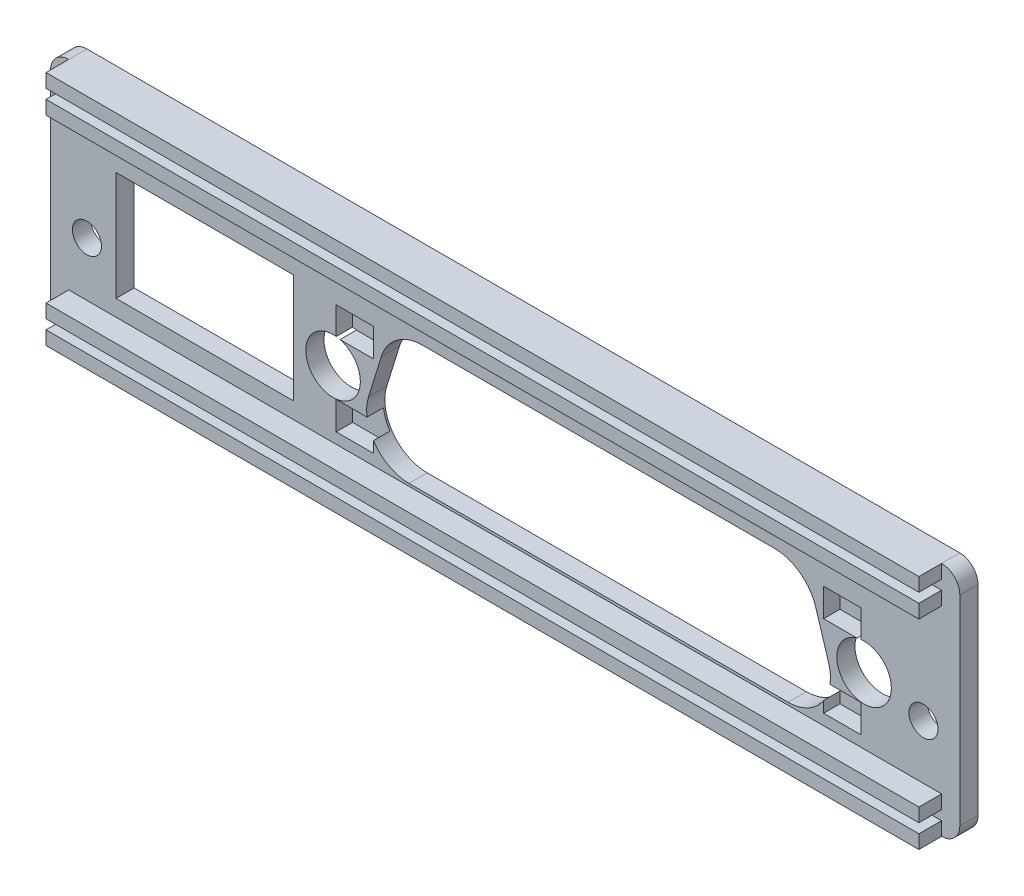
from build123d import *

# Parameters (mm, degrees)
SKETCH1_W                       = 112.5
SKETCH1_H                       = 24.2
BOSS_EXTRUDE1_DEPTH             = 4.5
SKETCH2_R                       = 3
SKETCH2_W                       = 19.5
SKETCH2_H                       = 12
CUT_EXTRUDE1_DEPTH              = 58.71241201
SKETCH3_W                       = 4.1
SKETCH3_H                       = 3.1
CUT_EXTRUDE2_DEPTH              = 1.8
SKETCH29_W                      = 112.5
SKETCH29_H                      = 4.5
BOSS_EXTRUDE2_DEPTH             = 0.9
SKETCH30_W                      = 112.5
SKETCH30_H                      = 4.5
BOSS_EXTRUDE3_DEPTH             = 0.9
SKETCH31_W                      = 106.5
SKETCH31_H                      = 1.05
CUT_EXTRUDE21_DEPTH             = 2.5
SKETCH32_W                      = 4.5
SKETCH32_H                      = 26
CUT_EXTRUDE22_DEPTH             = 2.5
SKETCH33_W                      = 4.5
SKETCH33_H                      = 26
CUT_EXTRUDE23_DEPTH             = 2.5
SKETCH34_W                      = 2.5
SKETCH34_H                      = 26
BOSS_EXTRUDE4_DEPTH             = 40
BOSS_EXTRUDE4_DIRECTION_2_REACH = 57.483
CUT_EXTRUDE24_DEPTH             = 75.46685515
SKETCH37_W                      = 4.5
SKETCH37_H                      = 26
CUT_EXTRUDE25_DEPTH             = 1.25
SKETCH38_W                      = 2.5
SKETCH38_H                      = 1.05
BOSS_EXTRUDE5_DEPTH             = 1.75
SKETCH39_R                      = 1.6
CUT_EXTRUDE26_DEPTH             = 52.857979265
SKETCH41_W                      = 96
SKETCH41_H                      = 1.5
BOSS_EXTRUDE6_DEPTH             = 2.5
FILLET1_R                       = 2
CUT_EXTRUDE28_DEPTH             = 2.5
SKETCH43_W                      = 96.5
SKETCH43_H                      = 2
BOSS_EXTRUDE7_DEPTH             = 1.05
SKETCH47_W                      = 96.5
SKETCH47_H                      = 2
BOSS_EXTRUDE8_DEPTH             = 1.05


with BuildPart() as part:
    # Sketch1 → Boss-Extrude1 (new body)
    with BuildSketch(Plane.XY):
        Rectangle(SKETCH1_W, SKETCH1_H)
    extrude(amount=BOSS_EXTRUDE1_DEPTH)

    # Sketch2 → Cut-Extrude1 (cut, through all)
    with BuildSketch(Plane.XY.offset(4.5)):
        with Locations((-18.930991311, -1.660001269)):
            Circle(SKETCH2_R)
        with Locations((39.469008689, -1.660001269)):
            Circle(SKETCH2_R)
        with BuildLine():
            Line((35.560404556, -2.632859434), (34.155917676, 1.896756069))
            add(Edge.make_bspline(
                [(34.155917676, 1.896756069), (34.011448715, 2.362683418), (33.590400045, 3.238757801), (32.490598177, 4.386859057), (31.068286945, 5.09730357), (30.106817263, 5.240007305), (29.619006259, 5.24000722)],
                knots=[0, 0, 0, 0, 0.25, 0.5, 0.75, 1, 1, 1, 1], degree=3))
            Line((29.619006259, 5.24000722), (-9.080993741, 5.240000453))
            add(Edge.make_bspline(
                [(-9.080993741, 5.240000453), (-9.568804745, 5.240000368), (-10.530274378, 5.097296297), (-11.952585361, 4.386851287), (-13.052386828, 3.238749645), (-13.473435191, 2.362675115), (-13.61790399, 1.896747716)],
                knots=[0, 0, 0, 0, 0.25, 0.5, 0.75, 1, 1, 1, 1], degree=3))
            Line((-13.61790399, 1.896747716), (-15.022389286, -2.632868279))
            add(Edge.make_bspline(
                [(-15.022389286, -2.632868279), (-15.119182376, -2.945036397), (-15.246475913, -3.5702918), (-15.228579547, -5.016610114), (-14.49151446, -6.8916668), (-12.918861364, -8.150978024), (-11.542726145, -8.596409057), (-10.907821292, -8.659999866), (-10.580991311, -8.659999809)],
                knots=[0, 0, 0, 0, 0.125, 0.25, 0.5, 0.75, 0.875, 1, 1, 1, 1], degree=3))
            Line((-10.580991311, -8.659999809), (31.119008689, -8.659992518))
            add(Edge.make_bspline(
                [(31.119008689, -8.659992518), (31.44583867, -8.659992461), (32.080743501, -8.596401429), (33.456878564, -8.150969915), (35.029531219, -6.891658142), (35.766595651, -5.016601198), (35.784491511, -3.570282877), (35.657197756, -2.945027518), (35.560404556, -2.632859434)],
                knots=[0, 0, 0, 0, 0.125, 0.25, 0.5, 0.75, 0.875, 1, 1, 1, 1], degree=3))
        make_face()
        with Locations((-33.05, -1.16)):
            Rectangle(SKETCH2_W, SKETCH2_H)
    extrude(amount=-CUT_EXTRUDE1_DEPTH, mode=Mode.SUBTRACT)

    # Sketch3 → Cut-Extrude2 (cut)
    with BuildSketch(Plane.XY.offset(4.5)):
        with Locations((-16.530993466, 2.789999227)):
            Rectangle(SKETCH3_W, SKETCH3_H)
        with Locations((-16.530991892, -6.210000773)):
            Rectangle(SKETCH3_W, SKETCH3_H)
        with Locations((37.069006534, 2.790008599)):
            Rectangle(SKETCH3_W, SKETCH3_H)
        with Locations((37.069008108, -6.209991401)):
            Rectangle(SKETCH3_W, SKETCH3_H)
    extrude(amount=-CUT_EXTRUDE2_DEPTH, mode=Mode.SUBTRACT)

    # Sketch29 → Boss-Extrude2 (add)
    with BuildSketch(Plane(origin=(0, 12.1, 0), x_dir=(1, 0, 0), z_dir=(0, 1, 0))):
        with Locations((0, -2.25)):
            Rectangle(SKETCH29_W, SKETCH29_H)
    extrude(amount=BOSS_EXTRUDE2_DEPTH)

    # Sketch30 → Boss-Extrude3 (add)
    with BuildSketch(Plane.XZ.offset(12.1)):
        with Locations((0, 2.25)):
            Rectangle(SKETCH30_W, SKETCH30_H)
    extrude(amount=BOSS_EXTRUDE3_DEPTH)

    # Sketch31 → Cut-Extrude21 (cut)
    with BuildSketch(Plane.XY.offset(4.5)):
        with Locations((0, -10.975)):
            Rectangle(SKETCH31_W, SKETCH31_H)
        with Locations((0, 10.975)):
            Rectangle(SKETCH31_W, SKETCH31_H)
    extrude(amount=-CUT_EXTRUDE21_DEPTH, mode=Mode.SUBTRACT)

    # Sketch32 → Cut-Extrude22 (cut)
    with BuildSketch(Plane(origin=(56.25, 0, 0), x_dir=(0, 0, -1), z_dir=(1, 0, 0))):
        with Locations((-2.25, 0)):
            Rectangle(SKETCH32_W, SKETCH32_H)
    extrude(amount=-CUT_EXTRUDE22_DEPTH, mode=Mode.SUBTRACT)

    # Sketch33 → Cut-Extrude23 (cut)
    with BuildSketch(Plane.ZY.offset(56.25)):
        with Locations((2.25, 0)):
            Rectangle(SKETCH33_W, SKETCH33_H)
    extrude(amount=-CUT_EXTRUDE23_DEPTH, mode=Mode.SUBTRACT)

    # Sketch34 → Boss-Extrude4 (add)
    with BuildSketch(Plane.XY.offset(4.5)):
        with Locations((52.5, 0)):
            Rectangle(SKETCH34_W, SKETCH34_H)
        with Locations((-52.5, 0)):
            Rectangle(SKETCH34_W, SKETCH34_H)
    extrude(amount=BOSS_EXTRUDE4_DEPTH)

    # Boss-Extrude4 direction 2: up to this face of the body (flat: up to its plane)
    boss_extrude4_direction_2_end = Plane(part.part.faces().sort_by_distance((0, 10.975, 2))[0])
    # Sketch34 → Boss-Extrude4 direction 2 (add, up to the picked face)
    with BuildSketch(Plane.XY.offset(4.5), mode=Mode.PRIVATE) as boss_extrude4_direction_2_sk1:
        with Locations((52.5, 0)):
            Rectangle(SKETCH34_W, SKETCH34_H)
    boss_extrude4_direction_2_tool1 = split(extrude(boss_extrude4_direction_2_sk1.sketch, amount=-BOSS_EXTRUDE4_DIRECTION_2_REACH, mode=Mode.PRIVATE), bisect_by=boss_extrude4_direction_2_end, keep=Keep.BOTH, mode=Mode.PRIVATE)
    # Sketch34 → Boss-Extrude4 direction 2 (add, up to the picked face)
    with BuildSketch(Plane.XY.offset(4.5), mode=Mode.PRIVATE) as boss_extrude4_direction_2_sk2:
        with Locations((-52.5, 0)):
            Rectangle(SKETCH34_W, SKETCH34_H)
    boss_extrude4_direction_2_tool2 = split(extrude(boss_extrude4_direction_2_sk2.sketch, amount=-BOSS_EXTRUDE4_DIRECTION_2_REACH, mode=Mode.PRIVATE), bisect_by=boss_extrude4_direction_2_end, keep=Keep.BOTH, mode=Mode.PRIVATE)
    add(boss_extrude4_direction_2_tool1.solids().sort_by(Axis((52.5, 0, 4.5), (0, 0, -1)))[0])
    add(boss_extrude4_direction_2_tool2.solids().sort_by(Axis((-52.5, 0, 4.5), (0, 0, -1)))[0])

    # Sketch36 → Cut-Extrude24 (cut, through all)
    with BuildSketch(Plane(origin=(0, 13, 0), x_dir=(1, 0, 0), z_dir=(0, 1, 0))):
        Polygon((-51.25, -4.5), (-51.25, 0), (-53.75, 0), (-53.75, -44.5), (-51.25, -44.5), align=None)
        Polygon((51.25, -4.5), (51.25, 0), (53.75, 0), (53.75, -44.5), (51.25, -44.5), align=None)
    extrude(amount=-CUT_EXTRUDE24_DEPTH, mode=Mode.SUBTRACT)

    # Sketch37 → Cut-Extrude25 (cut)
    with BuildSketch(Plane.ZY.offset(51.25)):
        with Locations((2.25, 0)):
            Rectangle(SKETCH37_W, SKETCH37_H)
    cut_extrude25 = extrude(amount=-CUT_EXTRUDE25_DEPTH, mode=Mode.SUBTRACT)

    # Mirror1: Cut-Extrude25 across plane
    add(cut_extrude25.mirror(Plane(origin=(0, 0, 0), x_dir=(0, 0, 1), z_dir=(1, 0, 0))), mode=Mode.SUBTRACT)

    # Sketch38 → Boss-Extrude5 (add)
    with BuildSketch(Plane.ZY.offset(50)):
        with Locations((3.25, 10.975)):
            Rectangle(SKETCH38_W, SKETCH38_H)
        with Locations((3.25, -10.975)):
            Rectangle(SKETCH38_W, SKETCH38_H)
    boss_extrude5 = extrude(amount=-BOSS_EXTRUDE5_DEPTH)

    # Mirror2: Boss-Extrude5 across plane
    add(boss_extrude5.mirror(Plane(origin=(0, 0, 0), x_dir=(0, 0, 1), z_dir=(1, 0, 0))))

    # Sketch39 → Cut-Extrude26 (cut, through all)
    with BuildSketch(Plane(origin=(0, 0, 0), x_dir=(-1, 0, 0), z_dir=(0, 0, -1))):
        with Locations((-46, -3)):
            Circle(SKETCH39_R)
        with Locations((46, -3)):
            Circle(SKETCH39_R)
    extrude(amount=-CUT_EXTRUDE26_DEPTH, mode=Mode.SUBTRACT)

    # Sketch41 → Boss-Extrude6 (add)
    with BuildSketch(Plane.XY.offset(4.5)):
        with Locations((0, 12.25)):
            Rectangle(SKETCH41_W, SKETCH41_H)
        with Locations((0, 9.7)):
            Rectangle(SKETCH41_W, SKETCH41_H)
    boss_extrude6 = extrude(amount=BOSS_EXTRUDE6_DEPTH)

    # Mirror3: Boss-Extrude6 across plane
    add(boss_extrude6.mirror(Plane.ZX))

    # Fillet1
    fillet1_edges = [part.edges().sort_by_distance(p)[0] for p in [
        (-50, -13, 2.25),
        (-50, 13, 2.25),
        (50, 13, 2.25),
        (50, -13, 2.25),
    ]]
    fillet(fillet1_edges, radius=FILLET1_R)

    # Sketch42 → Cut-Extrude28 (cut)
    with BuildSketch(Plane(origin=(0, 0, 0), x_dir=(-1, 0, 0), z_dir=(0, 0, -1))):
        with BuildLine():
            Line((-50, 11), (-50, -11))
            ThreePointArc((-50, -11), (-49.414213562, -12.414213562), (-48, -13))
            Line((-48, -13), (48, -13))
            ThreePointArc((48, -13), (49.414213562, -12.414213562), (50, -11))
            Line((50, -11), (50, 11))
            ThreePointArc((50, 11), (49.414213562, 12.414213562), (48, 13))
            Line((48, 13), (-48, 13))
            ThreePointArc((-48, 13), (-49.414213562, 12.414213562), (-50, 11))
        make_face()
    extrude(amount=-CUT_EXTRUDE28_DEPTH, mode=Mode.SUBTRACT)

    # Sketch43 → Boss-Extrude7 (add)
    with BuildSketch(Plane(origin=(0, 10.45, 0), x_dir=(1, 0, 0), z_dir=(0, 1, 0))):
        with Locations((0, -3.5)):
            Rectangle(SKETCH43_W, SKETCH43_H)
    extrude(amount=BOSS_EXTRUDE7_DEPTH)

    # Sketch47 → Boss-Extrude8 (add)
    with BuildSketch(Plane.XZ.offset(10.45)):
        with Locations((0, 3.5)):
            Rectangle(SKETCH47_W, SKETCH47_H)
    extrude(amount=BOSS_EXTRUDE8_DEPTH)


solid = part.part
